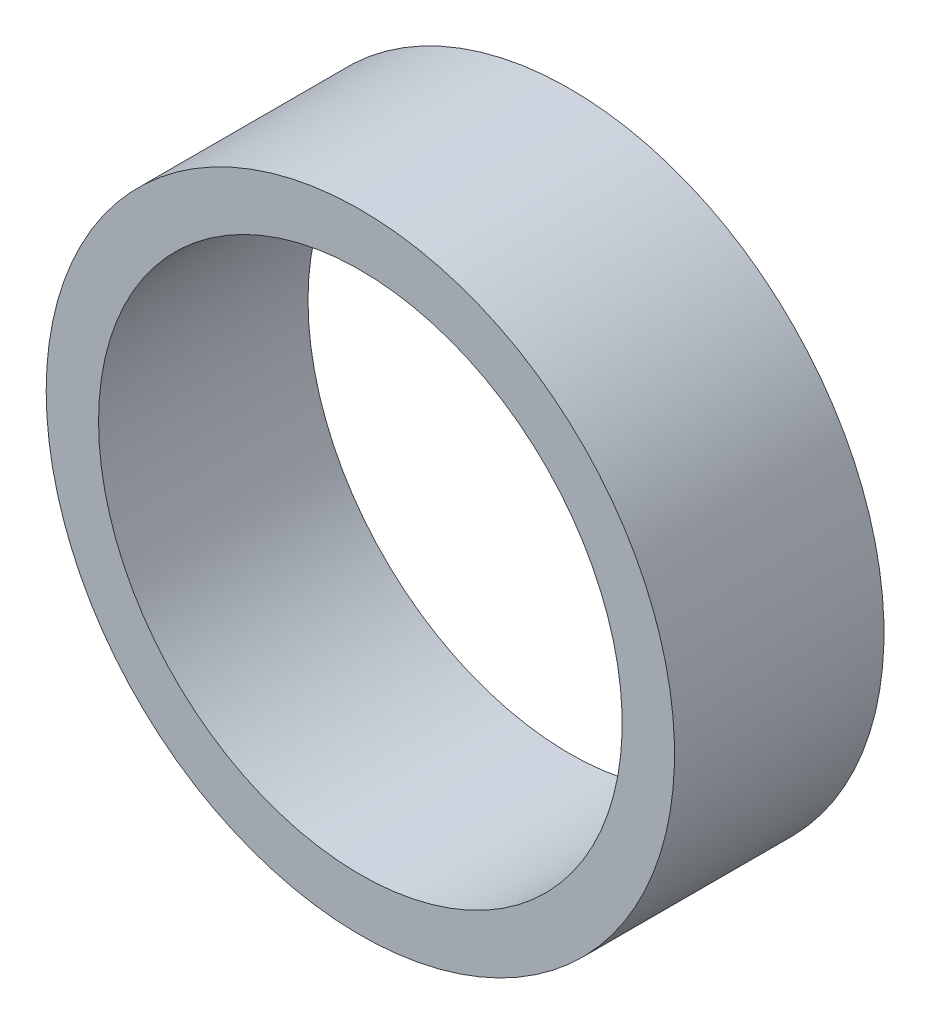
from build123d import *

# Parameters (mm, degrees)
LOGO3_BIB1_W = 1.5875
LOGO3_BIB1_H = 6.35


with BuildPart() as part:
    # Logo3_bib1 → Revolve1 (revolve)
    with BuildSketch(Plane(origin=(0, 0, 0), x_dir=(-1, 0, 0), z_dir=(0, -1, 0))):
        with Locations((8.73125, -3.175)):
            Rectangle(LOGO3_BIB1_W, LOGO3_BIB1_H)
    revolve(axis=Axis((0, 0, -38.976362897), (0, 0, 1)))


solid = part.part
